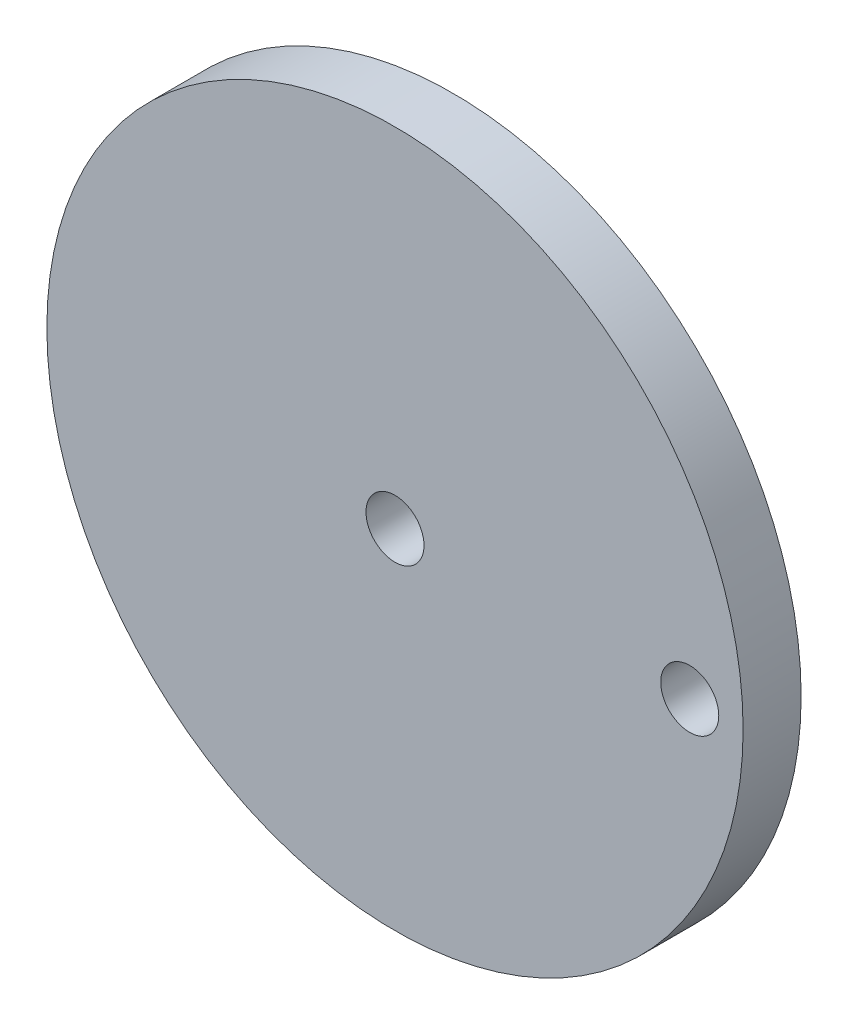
ISO-10303-21;
HEADER;
FILE_DESCRIPTION(('STEP AP214'),'2;1');
FILE_NAME('part.step','',(''),(''),'','','');
FILE_SCHEMA(('AUTOMOTIVE_DESIGN { 1 0 10303 214 1 1 1 1 }'));
ENDSEC;
DATA;
#1=APPLICATION_CONTEXT('core data for automotive mechanical design processes');
#2=APPLICATION_PROTOCOL_DEFINITION('international standard','automotive_design',2000,#1);
#3=PRODUCT_CONTEXT('',#1,'mechanical');
#4=PRODUCT('Part','Part','',(#3));
#5=PRODUCT_RELATED_PRODUCT_CATEGORY('part','',(#4));
#6=PRODUCT_DEFINITION_FORMATION('','',#4);
#7=PRODUCT_DEFINITION_CONTEXT('part definition',#1,'design');
#8=PRODUCT_DEFINITION('design','',#6,#7);
#9=PRODUCT_DEFINITION_SHAPE('','',#8);
#10=(LENGTH_UNIT() NAMED_UNIT(*) SI_UNIT(.MILLI.,.METRE.));
#11=(NAMED_UNIT(*) PLANE_ANGLE_UNIT() SI_UNIT($,.RADIAN.));
#12=(NAMED_UNIT(*) SI_UNIT($,.STERADIAN.) SOLID_ANGLE_UNIT());
#13=UNCERTAINTY_MEASURE_WITH_UNIT(LENGTH_MEASURE(1.E-05),#10,'distance_accuracy_value','');
#14=(GEOMETRIC_REPRESENTATION_CONTEXT(3) GLOBAL_UNCERTAINTY_ASSIGNED_CONTEXT((#13)) GLOBAL_UNIT_ASSIGNED_CONTEXT((#10,
#11,#12)) REPRESENTATION_CONTEXT('',''));
#15=CARTESIAN_POINT('',(0.,0.,0.));
#16=DIRECTION('',(0.,0.,1.));
#17=DIRECTION('',(1.,0.,0.));
#18=AXIS2_PLACEMENT_3D('',#15,#16,#17);
#19=CARTESIAN_POINT('',(0.,0.,5.));
#20=DIRECTION('',(0.,0.,1.));
#21=DIRECTION('',(1.,0.,0.));
#22=AXIS2_PLACEMENT_3D('',#19,#20,#21);
#23=PLANE('',#22);
#24=CARTESIAN_POINT('',(25.4,0.,5.));
#25=DIRECTION('',(0.,0.,1.));
#26=DIRECTION('',(1.,0.,0.));
#27=AXIS2_PLACEMENT_3D('',#24,#25,#26);
#28=CIRCLE('',#27,2.5);
#29=CARTESIAN_POINT('',(27.9,0.,5.));
#30=VERTEX_POINT('',#29);
#31=EDGE_CURVE('E42',#30,#30,#28,.T.);
#32=ORIENTED_EDGE('',*,*,#31,.F.);
#33=EDGE_LOOP('',(#32));
#34=FACE_BOUND('',#33,.T.);
#35=CARTESIAN_POINT('',(0.,0.,5.));
#36=DIRECTION('',(0.,0.,1.));
#37=DIRECTION('',(1.,0.,0.));
#38=AXIS2_PLACEMENT_3D('',#35,#36,#37);
#39=CIRCLE('',#38,30.);
#40=CARTESIAN_POINT('',(30.,0.,5.));
#41=VERTEX_POINT('',#40);
#42=EDGE_CURVE('E10',#41,#41,#39,.T.);
#43=ORIENTED_EDGE('',*,*,#42,.T.);
#44=EDGE_LOOP('',(#43));
#45=FACE_BOUND('',#44,.T.);
#46=CARTESIAN_POINT('',(0.,0.,5.));
#47=DIRECTION('',(0.,0.,1.));
#48=DIRECTION('',(1.,0.,0.));
#49=AXIS2_PLACEMENT_3D('',#46,#47,#48);
#50=CIRCLE('',#49,2.5);
#51=CARTESIAN_POINT('',(2.5,0.,5.));
#52=VERTEX_POINT('',#51);
#53=EDGE_CURVE('E47',#52,#52,#50,.T.);
#54=ORIENTED_EDGE('',*,*,#53,.F.);
#55=EDGE_LOOP('',(#54));
#56=FACE_BOUND('',#55,.T.);
#57=ADVANCED_FACE('F31',(#34,#45,#56),#23,.T.);
#58=CARTESIAN_POINT('',(0.,0.,0.));
#59=DIRECTION('',(0.,0.,1.));
#60=DIRECTION('',(1.,0.,0.));
#61=AXIS2_PLACEMENT_3D('',#58,#59,#60);
#62=PLANE('',#61);
#63=CARTESIAN_POINT('',(0.,0.,0.));
#64=DIRECTION('',(0.,0.,1.));
#65=DIRECTION('',(1.,0.,0.));
#66=AXIS2_PLACEMENT_3D('',#63,#64,#65);
#67=CIRCLE('',#66,30.);
#68=CARTESIAN_POINT('',(30.,0.,0.));
#69=VERTEX_POINT('',#68);
#70=EDGE_CURVE('E35',#69,#69,#67,.T.);
#71=ORIENTED_EDGE('',*,*,#70,.F.);
#72=EDGE_LOOP('',(#71));
#73=FACE_BOUND('',#72,.T.);
#74=CARTESIAN_POINT('',(25.4,0.,0.));
#75=DIRECTION('',(0.,0.,1.));
#76=DIRECTION('',(1.,0.,0.));
#77=AXIS2_PLACEMENT_3D('',#74,#75,#76);
#78=CIRCLE('',#77,2.5);
#79=CARTESIAN_POINT('',(27.9,0.,0.));
#80=VERTEX_POINT('',#79);
#81=EDGE_CURVE('E44',#80,#80,#78,.T.);
#82=ORIENTED_EDGE('',*,*,#81,.T.);
#83=EDGE_LOOP('',(#82));
#84=FACE_BOUND('',#83,.T.);
#85=CARTESIAN_POINT('',(0.,0.,0.));
#86=DIRECTION('',(0.,0.,1.));
#87=DIRECTION('',(1.,0.,0.));
#88=AXIS2_PLACEMENT_3D('',#85,#86,#87);
#89=CIRCLE('',#88,2.5);
#90=CARTESIAN_POINT('',(2.5,0.,0.));
#91=VERTEX_POINT('',#90);
#92=EDGE_CURVE('E50',#91,#91,#89,.T.);
#93=ORIENTED_EDGE('',*,*,#92,.T.);
#94=EDGE_LOOP('',(#93));
#95=FACE_BOUND('',#94,.T.);
#96=ADVANCED_FACE('F60',(#73,#84,#95),#62,.F.);
#97=CARTESIAN_POINT('',(0.,0.,5.));
#98=DIRECTION('',(0.,0.,-1.));
#99=DIRECTION('',(-1.,0.,0.));
#100=AXIS2_PLACEMENT_3D('',#97,#98,#99);
#101=CYLINDRICAL_SURFACE('',#100,30.);
#102=ORIENTED_EDGE('',*,*,#42,.F.);
#103=EDGE_LOOP('',(#102));
#104=FACE_BOUND('',#103,.T.);
#105=ORIENTED_EDGE('',*,*,#70,.T.);
#106=EDGE_LOOP('',(#105));
#107=FACE_BOUND('',#106,.T.);
#108=ADVANCED_FACE('F33',(#104,#107),#101,.T.);
#109=CARTESIAN_POINT('',(25.4,0.,5.));
#110=DIRECTION('',(0.,0.,-1.));
#111=DIRECTION('',(-1.,0.,0.));
#112=AXIS2_PLACEMENT_3D('',#109,#110,#111);
#113=CYLINDRICAL_SURFACE('',#112,2.5);
#114=ORIENTED_EDGE('',*,*,#31,.T.);
#115=EDGE_LOOP('',(#114));
#116=FACE_BOUND('',#115,.T.);
#117=ORIENTED_EDGE('',*,*,#81,.F.);
#118=EDGE_LOOP('',(#117));
#119=FACE_BOUND('',#118,.T.);
#120=ADVANCED_FACE('F69',(#116,#119),#113,.F.);
#121=CARTESIAN_POINT('',(0.,0.,5.));
#122=DIRECTION('',(0.,0.,-1.));
#123=DIRECTION('',(-1.,0.,0.));
#124=AXIS2_PLACEMENT_3D('',#121,#122,#123);
#125=CYLINDRICAL_SURFACE('',#124,2.5);
#126=ORIENTED_EDGE('',*,*,#53,.T.);
#127=EDGE_LOOP('',(#126));
#128=FACE_BOUND('',#127,.T.);
#129=ORIENTED_EDGE('',*,*,#92,.F.);
#130=EDGE_LOOP('',(#129));
#131=FACE_BOUND('',#130,.T.);
#132=ADVANCED_FACE('F56',(#128,#131),#125,.F.);
#133=CLOSED_SHELL('',(#57,#96,#108,#120,#132));
#134=MANIFOLD_SOLID_BREP('B2',#133);
#135=ADVANCED_BREP_SHAPE_REPRESENTATION('',(#18,#134),#14);
#136=SHAPE_DEFINITION_REPRESENTATION(#9,#135);
ENDSEC;
END-ISO-10303-21;
